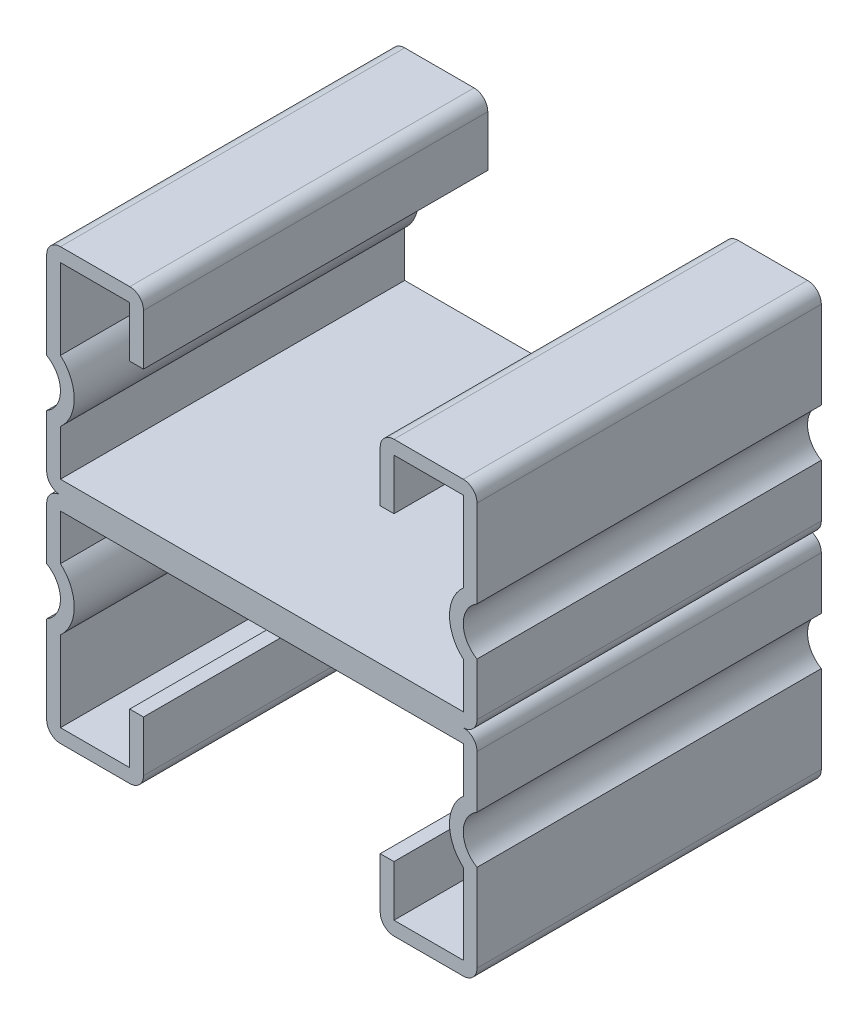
from build123d import *

# Parameters (mm, degrees)
BASE_EXTRUDE_DEPTH = 12.7


with BuildPart() as part:
    # Sketch1 → Base-Extrude (new, symmetric)
    with BuildSketch(Plane.XY):
        with BuildLine():
            Line((-15.875, 14.859), (-15.875, 8.41456362))
            ThreePointArc((-15.875, 8.41456362), (-14.859, 6.6548), (-15.875, 4.89503638))
            Line((-15.875, 4.89503638), (-15.875, 1.016))
            ThreePointArc((-15.875, 1.016), (-15.57742049, 0.29757951), (-14.859, 0))
            Line((-14.859, 0), (14.859, 0))
            ThreePointArc((14.859, 0), (15.57742049, 0.29757951), (15.875, 1.016))
            Line((15.875, 1.016), (15.875, 4.89503638))
            ThreePointArc((15.875, 4.89503638), (14.859, 6.6548), (15.875, 8.41456362))
            Line((15.875, 8.41456362), (15.875, 14.859))
            ThreePointArc((15.875, 14.859), (15.57742049, 15.57742049), (14.859, 15.875))
            Line((14.859, 15.875), (9.74725, 15.875))
            ThreePointArc((9.74725, 15.875), (9.02882951, 15.57742049), (8.73125, 14.859))
            Line((8.73125, 14.859), (8.73125, 11.1125))
            Line((8.73125, 11.1125), (9.74725, 11.1125))
            Line((9.74725, 11.1125), (9.74725, 14.859))
            Line((9.74725, 14.859), (14.859, 14.859))
            Line((14.859, 14.859), (14.859, 8.926645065))
            ThreePointArc((14.859, 8.926645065), (13.843, 6.6548), (14.859, 4.382954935))
            Line((14.859, 4.382954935), (14.859, 1.016))
            Line((14.859, 1.016), (-14.859, 1.016))
            Line((-14.859, 1.016), (-14.859, 4.382954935))
            ThreePointArc((-14.859, 4.382954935), (-13.843, 6.6548), (-14.859, 8.926645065))
            Line((-14.859, 8.926645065), (-14.859, 14.859))
            Line((-14.859, 14.859), (-9.74725, 14.859))
            Line((-9.74725, 14.859), (-9.74725, 11.1125))
            Line((-9.74725, 11.1125), (-8.73125, 11.1125))
            Line((-8.73125, 11.1125), (-8.73125, 14.859))
            ThreePointArc((-8.73125, 14.859), (-9.02882951, 15.57742049), (-9.74725, 15.875))
            Line((-9.74725, 15.875), (-14.859, 15.875))
            ThreePointArc((-14.859, 15.875), (-15.57742049, 15.57742049), (-15.875, 14.859))
        make_face()
    base_extrude = extrude(amount=BASE_EXTRUDE_DEPTH, both=True)

    # Mirror1: Base-Extrude across plane
    add(base_extrude.mirror(Plane.ZX))


solid = part.part
